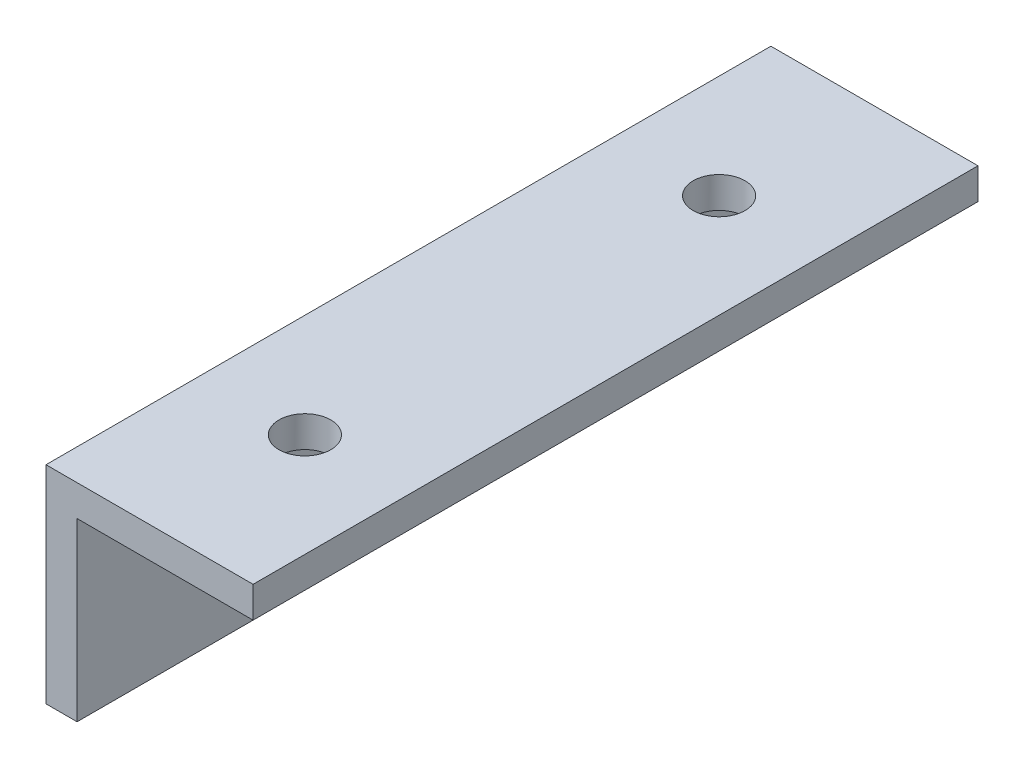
ISO-10303-21;
HEADER;
FILE_DESCRIPTION(('STEP AP214'),'2;1');
FILE_NAME('part.step','',(''),(''),'','','');
FILE_SCHEMA(('AUTOMOTIVE_DESIGN { 1 0 10303 214 1 1 1 1 }'));
ENDSEC;
DATA;
#1=APPLICATION_CONTEXT('core data for automotive mechanical design processes');
#2=APPLICATION_PROTOCOL_DEFINITION('international standard','automotive_design',2000,#1);
#3=PRODUCT_CONTEXT('',#1,'mechanical');
#4=PRODUCT('Part','Part','',(#3));
#5=PRODUCT_RELATED_PRODUCT_CATEGORY('part','',(#4));
#6=PRODUCT_DEFINITION_FORMATION('','',#4);
#7=PRODUCT_DEFINITION_CONTEXT('part definition',#1,'design');
#8=PRODUCT_DEFINITION('design','',#6,#7);
#9=PRODUCT_DEFINITION_SHAPE('','',#8);
#10=(LENGTH_UNIT() NAMED_UNIT(*) SI_UNIT(.MILLI.,.METRE.));
#11=(NAMED_UNIT(*) PLANE_ANGLE_UNIT() SI_UNIT($,.RADIAN.));
#12=(NAMED_UNIT(*) SI_UNIT($,.STERADIAN.) SOLID_ANGLE_UNIT());
#13=UNCERTAINTY_MEASURE_WITH_UNIT(LENGTH_MEASURE(1.E-05),#10,'distance_accuracy_value','');
#14=(GEOMETRIC_REPRESENTATION_CONTEXT(3) GLOBAL_UNCERTAINTY_ASSIGNED_CONTEXT((#13)) GLOBAL_UNIT_ASSIGNED_CONTEXT((#10,
#11,#12)) REPRESENTATION_CONTEXT('',''));
#15=CARTESIAN_POINT('',(0.,0.,0.));
#16=DIRECTION('',(0.,0.,1.));
#17=DIRECTION('',(1.,0.,0.));
#18=AXIS2_PLACEMENT_3D('',#15,#16,#17);
#19=CARTESIAN_POINT('',(0.,0.,70.));
#20=DIRECTION('',(1.,0.,0.));
#21=DIRECTION('',(0.,0.,-1.));
#22=AXIS2_PLACEMENT_3D('',#19,#20,#21);
#23=PLANE('',#22);
#24=DIRECTION('',(0.,-1.,0.));
#25=VECTOR('',#24,1.);
#26=CARTESIAN_POINT('',(0.,0.,0.));
#27=LINE('',#26,#25);
#28=CARTESIAN_POINT('',(0.,20.,0.));
#29=VERTEX_POINT('',#28);
#30=CARTESIAN_POINT('',(0.,0.,0.));
#31=VERTEX_POINT('',#30);
#32=EDGE_CURVE('E115',#29,#31,#27,.T.);
#33=ORIENTED_EDGE('',*,*,#32,.T.);
#34=DIRECTION('',(0.,0.,-1.));
#35=VECTOR('',#34,1.);
#36=CARTESIAN_POINT('',(0.,0.,70.));
#37=LINE('',#36,#35);
#38=CARTESIAN_POINT('',(0.,0.,70.));
#39=VERTEX_POINT('',#38);
#40=EDGE_CURVE('E11',#39,#31,#37,.T.);
#41=ORIENTED_EDGE('',*,*,#40,.F.);
#42=DIRECTION('',(0.,-1.,0.));
#43=VECTOR('',#42,1.);
#44=CARTESIAN_POINT('',(0.,0.,70.));
#45=LINE('',#44,#43);
#46=CARTESIAN_POINT('',(0.,20.,70.));
#47=VERTEX_POINT('',#46);
#48=EDGE_CURVE('E125',#47,#39,#45,.T.);
#49=ORIENTED_EDGE('',*,*,#48,.F.);
#50=DIRECTION('',(0.,0.,-1.));
#51=VECTOR('',#50,1.);
#52=CARTESIAN_POINT('',(0.,20.,70.));
#53=LINE('',#52,#51);
#54=EDGE_CURVE('E111',#47,#29,#53,.T.);
#55=ORIENTED_EDGE('',*,*,#54,.T.);
#56=EDGE_LOOP('',(#33,#41,#49,#55));
#57=FACE_BOUND('',#56,.T.);
#58=ADVANCED_FACE('F30',(#57),#23,.F.);
#59=CARTESIAN_POINT('',(0.,0.,70.));
#60=DIRECTION('',(0.,1.,0.));
#61=DIRECTION('',(0.,0.,1.));
#62=AXIS2_PLACEMENT_3D('',#59,#60,#61);
#63=PLANE('',#62);
#64=DIRECTION('',(1.,0.,0.));
#65=VECTOR('',#64,1.);
#66=CARTESIAN_POINT('',(0.,0.,0.));
#67=LINE('',#66,#65);
#68=CARTESIAN_POINT('',(3.,0.,0.));
#69=VERTEX_POINT('',#68);
#70=EDGE_CURVE('E118',#31,#69,#67,.T.);
#71=ORIENTED_EDGE('',*,*,#70,.T.);
#72=DIRECTION('',(0.,0.,-1.));
#73=VECTOR('',#72,1.);
#74=CARTESIAN_POINT('',(3.,0.,70.));
#75=LINE('',#74,#73);
#76=CARTESIAN_POINT('',(3.,0.,70.));
#77=VERTEX_POINT('',#76);
#78=EDGE_CURVE('E39',#77,#69,#75,.T.);
#79=ORIENTED_EDGE('',*,*,#78,.F.);
#80=DIRECTION('',(1.,0.,0.));
#81=VECTOR('',#80,1.);
#82=CARTESIAN_POINT('',(0.,0.,70.));
#83=LINE('',#82,#81);
#84=EDGE_CURVE('E84',#39,#77,#83,.T.);
#85=ORIENTED_EDGE('',*,*,#84,.F.);
#86=ORIENTED_EDGE('',*,*,#40,.T.);
#87=EDGE_LOOP('',(#71,#79,#85,#86));
#88=FACE_BOUND('',#87,.T.);
#89=ADVANCED_FACE('F153',(#88),#63,.F.);
#90=CARTESIAN_POINT('',(3.,17.,70.));
#91=DIRECTION('',(-1.,0.,0.));
#92=DIRECTION('',(0.,-1.,0.));
#93=AXIS2_PLACEMENT_3D('',#90,#91,#92);
#94=PLANE('',#93);
#95=DIRECTION('',(0.,1.,0.));
#96=VECTOR('',#95,1.);
#97=CARTESIAN_POINT('',(3.,17.,0.));
#98=LINE('',#97,#96);
#99=CARTESIAN_POINT('',(3.,17.,0.));
#100=VERTEX_POINT('',#99);
#101=EDGE_CURVE('E120',#69,#100,#98,.T.);
#102=ORIENTED_EDGE('',*,*,#101,.T.);
#103=DIRECTION('',(0.,0.,-1.));
#104=VECTOR('',#103,1.);
#105=CARTESIAN_POINT('',(3.,17.,70.));
#106=LINE('',#105,#104);
#107=CARTESIAN_POINT('',(3.,17.,70.));
#108=VERTEX_POINT('',#107);
#109=EDGE_CURVE('E106',#108,#100,#106,.T.);
#110=ORIENTED_EDGE('',*,*,#109,.F.);
#111=DIRECTION('',(0.,1.,0.));
#112=VECTOR('',#111,1.);
#113=CARTESIAN_POINT('',(3.,17.,70.));
#114=LINE('',#113,#112);
#115=EDGE_CURVE('E97',#77,#108,#114,.T.);
#116=ORIENTED_EDGE('',*,*,#115,.F.);
#117=ORIENTED_EDGE('',*,*,#78,.T.);
#118=EDGE_LOOP('',(#102,#110,#116,#117));
#119=FACE_BOUND('',#118,.T.);
#120=ADVANCED_FACE('F132',(#119),#94,.F.);
#121=CARTESIAN_POINT('',(20.,17.,70.));
#122=DIRECTION('',(0.,1.,0.));
#123=DIRECTION('',(-1.,0.,0.));
#124=AXIS2_PLACEMENT_3D('',#121,#122,#123);
#125=PLANE('',#124);
#126=CARTESIAN_POINT('',(10.,17.,15.));
#127=DIRECTION('',(0.,1.,0.));
#128=DIRECTION('',(-1.,0.,0.));
#129=AXIS2_PLACEMENT_3D('',#126,#127,#128);
#130=CIRCLE('',#129,2.49999999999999);
#131=CARTESIAN_POINT('',(7.50000000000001,17.,15.));
#132=VERTEX_POINT('',#131);
#133=EDGE_CURVE('E169',#132,#132,#130,.T.);
#134=ORIENTED_EDGE('',*,*,#133,.T.);
#135=EDGE_LOOP('',(#134));
#136=FACE_BOUND('',#135,.T.);
#137=CARTESIAN_POINT('',(10.,17.,55.));
#138=DIRECTION('',(0.,1.,0.));
#139=DIRECTION('',(-1.,0.,0.));
#140=AXIS2_PLACEMENT_3D('',#137,#138,#139);
#141=CIRCLE('',#140,2.49999999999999);
#142=CARTESIAN_POINT('',(7.50000000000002,17.,55.));
#143=VERTEX_POINT('',#142);
#144=EDGE_CURVE('E33',#143,#143,#141,.T.);
#145=ORIENTED_EDGE('',*,*,#144,.T.);
#146=EDGE_LOOP('',(#145));
#147=FACE_BOUND('',#146,.T.);
#148=DIRECTION('',(1.,0.,0.));
#149=VECTOR('',#148,1.);
#150=CARTESIAN_POINT('',(20.,17.,0.));
#151=LINE('',#150,#149);
#152=CARTESIAN_POINT('',(20.,17.,0.));
#153=VERTEX_POINT('',#152);
#154=EDGE_CURVE('E105',#100,#153,#151,.T.);
#155=ORIENTED_EDGE('',*,*,#154,.T.);
#156=DIRECTION('',(0.,0.,-1.));
#157=VECTOR('',#156,1.);
#158=CARTESIAN_POINT('',(20.,17.,70.));
#159=LINE('',#158,#157);
#160=CARTESIAN_POINT('',(20.,17.,70.));
#161=VERTEX_POINT('',#160);
#162=EDGE_CURVE('E102',#161,#153,#159,.T.);
#163=ORIENTED_EDGE('',*,*,#162,.F.);
#164=DIRECTION('',(1.,0.,0.));
#165=VECTOR('',#164,1.);
#166=CARTESIAN_POINT('',(20.,17.,70.));
#167=LINE('',#166,#165);
#168=EDGE_CURVE('E91',#108,#161,#167,.T.);
#169=ORIENTED_EDGE('',*,*,#168,.F.);
#170=ORIENTED_EDGE('',*,*,#109,.T.);
#171=EDGE_LOOP('',(#155,#163,#169,#170));
#172=FACE_BOUND('',#171,.T.);
#173=ADVANCED_FACE('F103',(#136,#147,#172),#125,.F.);
#174=CARTESIAN_POINT('',(20.,20.,70.));
#175=DIRECTION('',(-1.,0.,0.));
#176=DIRECTION('',(0.,0.,1.));
#177=AXIS2_PLACEMENT_3D('',#174,#175,#176);
#178=PLANE('',#177);
#179=DIRECTION('',(0.,1.,0.));
#180=VECTOR('',#179,1.);
#181=CARTESIAN_POINT('',(20.,20.,0.));
#182=LINE('',#181,#180);
#183=CARTESIAN_POINT('',(20.,20.,0.));
#184=VERTEX_POINT('',#183);
#185=EDGE_CURVE('E70',#153,#184,#182,.T.);
#186=ORIENTED_EDGE('',*,*,#185,.T.);
#187=DIRECTION('',(0.,0.,-1.));
#188=VECTOR('',#187,1.);
#189=CARTESIAN_POINT('',(20.,20.,70.));
#190=LINE('',#189,#188);
#191=CARTESIAN_POINT('',(20.,20.,70.));
#192=VERTEX_POINT('',#191);
#193=EDGE_CURVE('E107',#192,#184,#190,.T.);
#194=ORIENTED_EDGE('',*,*,#193,.F.);
#195=DIRECTION('',(0.,1.,0.));
#196=VECTOR('',#195,1.);
#197=CARTESIAN_POINT('',(20.,20.,70.));
#198=LINE('',#197,#196);
#199=EDGE_CURVE('E95',#161,#192,#198,.T.);
#200=ORIENTED_EDGE('',*,*,#199,.F.);
#201=ORIENTED_EDGE('',*,*,#162,.T.);
#202=EDGE_LOOP('',(#186,#194,#200,#201));
#203=FACE_BOUND('',#202,.T.);
#204=ADVANCED_FACE('F109',(#203),#178,.F.);
#205=CARTESIAN_POINT('',(0.,20.,70.));
#206=DIRECTION('',(0.,-1.,0.));
#207=DIRECTION('',(0.,0.,-1.));
#208=AXIS2_PLACEMENT_3D('',#205,#206,#207);
#209=PLANE('',#208);
#210=CARTESIAN_POINT('',(10.,20.,15.));
#211=DIRECTION('',(0.,1.,0.));
#212=DIRECTION('',(0.,0.,1.));
#213=AXIS2_PLACEMENT_3D('',#210,#211,#212);
#214=CIRCLE('',#213,2.49999999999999);
#215=CARTESIAN_POINT('',(10.,20.,17.5));
#216=VERTEX_POINT('',#215);
#217=EDGE_CURVE('E178',#216,#216,#214,.T.);
#218=ORIENTED_EDGE('',*,*,#217,.F.);
#219=EDGE_LOOP('',(#218));
#220=FACE_BOUND('',#219,.T.);
#221=CARTESIAN_POINT('',(10.,20.,55.));
#222=DIRECTION('',(0.,1.,0.));
#223=DIRECTION('',(0.,0.,1.));
#224=AXIS2_PLACEMENT_3D('',#221,#222,#223);
#225=CIRCLE('',#224,2.49999999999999);
#226=CARTESIAN_POINT('',(10.,20.,57.5));
#227=VERTEX_POINT('',#226);
#228=EDGE_CURVE('E173',#227,#227,#225,.T.);
#229=ORIENTED_EDGE('',*,*,#228,.F.);
#230=EDGE_LOOP('',(#229));
#231=FACE_BOUND('',#230,.T.);
#232=DIRECTION('',(-1.,0.,0.));
#233=VECTOR('',#232,1.);
#234=CARTESIAN_POINT('',(0.,20.,0.));
#235=LINE('',#234,#233);
#236=EDGE_CURVE('E76',#184,#29,#235,.T.);
#237=ORIENTED_EDGE('',*,*,#236,.T.);
#238=ORIENTED_EDGE('',*,*,#54,.F.);
#239=DIRECTION('',(-1.,0.,0.));
#240=VECTOR('',#239,1.);
#241=CARTESIAN_POINT('',(0.,20.,70.));
#242=LINE('',#241,#240);
#243=EDGE_CURVE('E47',#192,#47,#242,.T.);
#244=ORIENTED_EDGE('',*,*,#243,.F.);
#245=ORIENTED_EDGE('',*,*,#193,.T.);
#246=EDGE_LOOP('',(#237,#238,#244,#245));
#247=FACE_BOUND('',#246,.T.);
#248=ADVANCED_FACE('F139',(#220,#231,#247),#209,.F.);
#249=CARTESIAN_POINT('',(0.,20.,70.));
#250=DIRECTION('',(0.,0.,-1.));
#251=DIRECTION('',(-1.,0.,0.));
#252=AXIS2_PLACEMENT_3D('',#249,#250,#251);
#253=PLANE('',#252);
#254=ORIENTED_EDGE('',*,*,#48,.T.);
#255=ORIENTED_EDGE('',*,*,#84,.T.);
#256=ORIENTED_EDGE('',*,*,#115,.T.);
#257=ORIENTED_EDGE('',*,*,#168,.T.);
#258=ORIENTED_EDGE('',*,*,#199,.T.);
#259=ORIENTED_EDGE('',*,*,#243,.T.);
#260=EDGE_LOOP('',(#254,#255,#256,#257,#258,#259));
#261=FACE_BOUND('',#260,.T.);
#262=ADVANCED_FACE('F93',(#261),#253,.F.);
#263=CARTESIAN_POINT('',(0.,20.,0.));
#264=DIRECTION('',(0.,0.,-1.));
#265=DIRECTION('',(-1.,0.,0.));
#266=AXIS2_PLACEMENT_3D('',#263,#264,#265);
#267=PLANE('',#266);
#268=ORIENTED_EDGE('',*,*,#32,.F.);
#269=ORIENTED_EDGE('',*,*,#236,.F.);
#270=ORIENTED_EDGE('',*,*,#185,.F.);
#271=ORIENTED_EDGE('',*,*,#154,.F.);
#272=ORIENTED_EDGE('',*,*,#101,.F.);
#273=ORIENTED_EDGE('',*,*,#70,.F.);
#274=EDGE_LOOP('',(#268,#269,#270,#271,#272,#273));
#275=FACE_BOUND('',#274,.T.);
#276=ADVANCED_FACE('F135',(#275),#267,.T.);
#277=CARTESIAN_POINT('',(10.,20.,55.));
#278=DIRECTION('',(0.,1.,0.));
#279=DIRECTION('',(0.,0.,1.));
#280=AXIS2_PLACEMENT_3D('',#277,#278,#279);
#281=CYLINDRICAL_SURFACE('',#280,2.49999999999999);
#282=ORIENTED_EDGE('',*,*,#228,.T.);
#283=EDGE_LOOP('',(#282));
#284=FACE_BOUND('',#283,.T.);
#285=ORIENTED_EDGE('',*,*,#144,.F.);
#286=EDGE_LOOP('',(#285));
#287=FACE_BOUND('',#286,.T.);
#288=ADVANCED_FACE('F188',(#284,#287),#281,.F.);
#289=CARTESIAN_POINT('',(10.,20.,15.));
#290=DIRECTION('',(0.,1.,0.));
#291=DIRECTION('',(0.,0.,1.));
#292=AXIS2_PLACEMENT_3D('',#289,#290,#291);
#293=CYLINDRICAL_SURFACE('',#292,2.49999999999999);
#294=ORIENTED_EDGE('',*,*,#217,.T.);
#295=EDGE_LOOP('',(#294));
#296=FACE_BOUND('',#295,.T.);
#297=ORIENTED_EDGE('',*,*,#133,.F.);
#298=EDGE_LOOP('',(#297));
#299=FACE_BOUND('',#298,.T.);
#300=ADVANCED_FACE('F185',(#296,#299),#293,.F.);
#301=CLOSED_SHELL('',(#58,#89,#120,#173,#204,#248,#262,#276,#288,#300));
#302=MANIFOLD_SOLID_BREP('B2',#301);
#303=ADVANCED_BREP_SHAPE_REPRESENTATION('',(#18,#302),#14);
#304=SHAPE_DEFINITION_REPRESENTATION(#9,#303);
ENDSEC;
END-ISO-10303-21;
